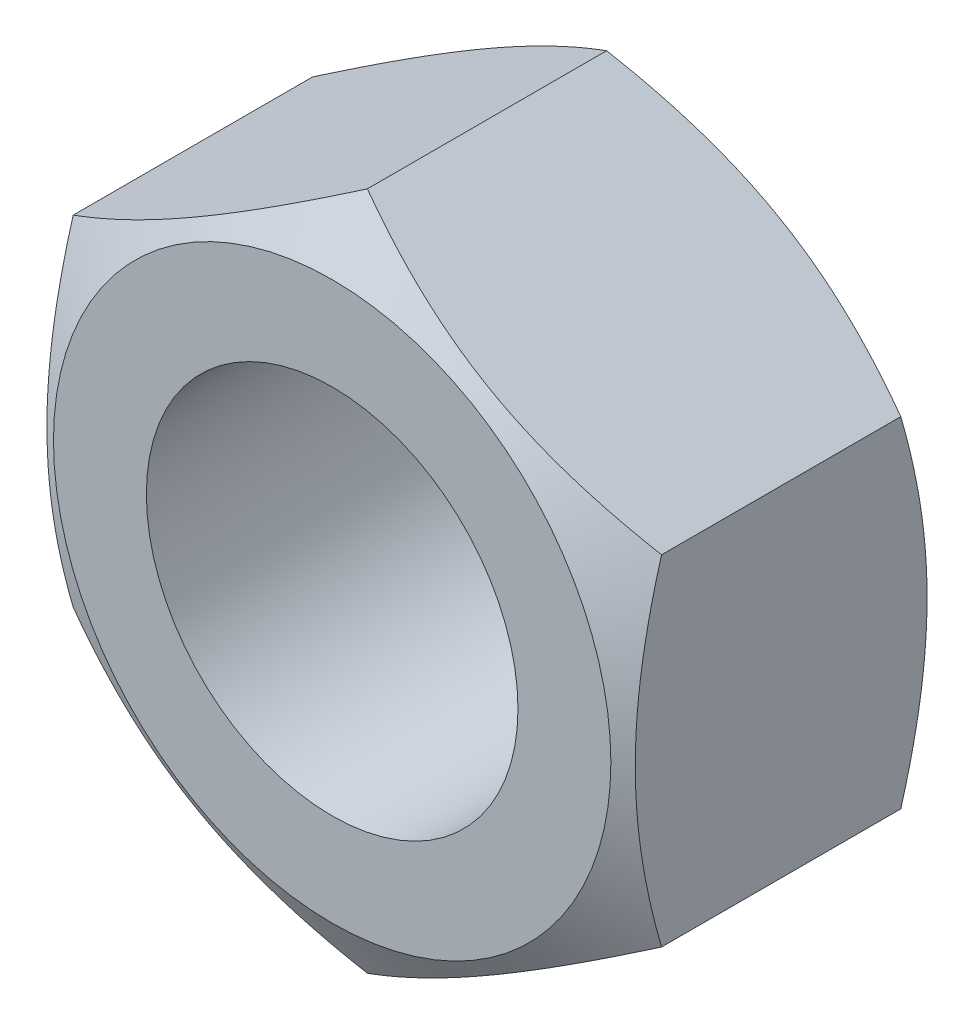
ISO-10303-21;
HEADER;
FILE_DESCRIPTION(('STEP AP214'),'2;1');
FILE_NAME('part.step','',(''),(''),'','','');
FILE_SCHEMA(('AUTOMOTIVE_DESIGN { 1 0 10303 214 1 1 1 1 }'));
ENDSEC;
DATA;
#1=APPLICATION_CONTEXT('core data for automotive mechanical design processes');
#2=APPLICATION_PROTOCOL_DEFINITION('international standard','automotive_design',2000,#1);
#3=PRODUCT_CONTEXT('',#1,'mechanical');
#4=PRODUCT('Part','Part','',(#3));
#5=PRODUCT_RELATED_PRODUCT_CATEGORY('part','',(#4));
#6=PRODUCT_DEFINITION_FORMATION('','',#4);
#7=PRODUCT_DEFINITION_CONTEXT('part definition',#1,'design');
#8=PRODUCT_DEFINITION('design','',#6,#7);
#9=PRODUCT_DEFINITION_SHAPE('','',#8);
#10=(LENGTH_UNIT() NAMED_UNIT(*) SI_UNIT(.MILLI.,.METRE.));
#11=(NAMED_UNIT(*) PLANE_ANGLE_UNIT() SI_UNIT($,.RADIAN.));
#12=(NAMED_UNIT(*) SI_UNIT($,.STERADIAN.) SOLID_ANGLE_UNIT());
#13=UNCERTAINTY_MEASURE_WITH_UNIT(LENGTH_MEASURE(1.E-05),#10,'distance_accuracy_value','');
#14=(GEOMETRIC_REPRESENTATION_CONTEXT(3) GLOBAL_UNCERTAINTY_ASSIGNED_CONTEXT((#13)) GLOBAL_UNIT_ASSIGNED_CONTEXT((#10,
#11,#12)) REPRESENTATION_CONTEXT('',''));
#15=CARTESIAN_POINT('',(0.,0.,0.));
#16=DIRECTION('',(0.,0.,1.));
#17=DIRECTION('',(1.,0.,0.));
#18=AXIS2_PLACEMENT_3D('',#15,#16,#17);
#19=CARTESIAN_POINT('',(-9.5,-5.48482755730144,10.));
#20=DIRECTION('',(-1.,0.,0.));
#21=DIRECTION('',(0.,0.,1.));
#22=AXIS2_PLACEMENT_3D('',#19,#20,#21);
#23=PLANE('',#22);
#24=DIRECTION('',(0.,0.,-1.));
#25=VECTOR('',#24,1.);
#26=CARTESIAN_POINT('',(-9.5,-5.48482755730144,10.));
#27=LINE('',#26,#25);
#28=CARTESIAN_POINT('',(-9.5,-5.48482755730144,8.86281908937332));
#29=VERTEX_POINT('',#28);
#30=CARTESIAN_POINT('',(-9.5,-5.48482755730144,1.13718091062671));
#31=VERTEX_POINT('',#30);
#32=EDGE_CURVE('E9',#29,#31,#27,.T.);
#33=ORIENTED_EDGE('',*,*,#32,.F.);
#34=CARTESIAN_POINT('',(-9.5,-14.6203705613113,5.12961982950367));
#35=CARTESIAN_POINT('',(-9.5,-14.4133760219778,5.22982896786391));
#36=CARTESIAN_POINT('',(-9.5,-14.2061355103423,5.32952978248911));
#37=CARTESIAN_POINT('',(-9.5,-13.7911111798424,5.52779940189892));
#38=CARTESIAN_POINT('',(-9.5,-13.5833273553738,5.62636819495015));
#39=CARTESIAN_POINT('',(-9.5,-12.959026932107,5.92023022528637));
#40=CARTESIAN_POINT('',(-9.5,-12.5416243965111,6.11364852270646));
#41=CARTESIAN_POINT('',(-9.5,-11.7016619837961,6.49535955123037));
#42=CARTESIAN_POINT('',(-9.5,-11.279086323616,6.68361763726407));
#43=CARTESIAN_POINT('',(-9.5,-10.4305349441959,7.05228047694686));
#44=CARTESIAN_POINT('',(-9.5,-10.004559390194,7.23268560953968));
#45=CARTESIAN_POINT('',(-9.5,-9.13523598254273,7.58900936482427));
#46=CARTESIAN_POINT('',(-9.5,-8.69175917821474,7.7646151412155));
#47=CARTESIAN_POINT('',(-9.5,-7.79957695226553,8.10226180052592));
#48=CARTESIAN_POINT('',(-9.5,-7.3508709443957,8.26430114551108));
#49=CARTESIAN_POINT('',(-9.5,-6.44838780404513,8.57047760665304));
#50=CARTESIAN_POINT('',(-9.5,-5.99462344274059,8.71465195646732));
#51=CARTESIAN_POINT('',(-9.5,-5.08060402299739,8.98040038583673));
#52=CARTESIAN_POINT('',(-9.5,-4.62035109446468,9.10198170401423));
#53=CARTESIAN_POINT('',(-9.5,-3.69554066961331,9.31598884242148));
#54=CARTESIAN_POINT('',(-9.5,-3.23101965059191,9.40856799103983));
#55=CARTESIAN_POINT('',(-9.5,-2.53009968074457,9.52161967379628));
#56=CARTESIAN_POINT('',(-9.5,-2.29575188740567,9.55500229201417));
#57=CARTESIAN_POINT('',(-9.5,-1.82593015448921,9.61250466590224));
#58=CARTESIAN_POINT('',(-9.5,-1.59045632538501,9.63662531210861));
#59=CARTESIAN_POINT('',(-9.5,-1.12172453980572,9.67482643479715));
#60=CARTESIAN_POINT('',(-9.5,-0.888476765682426,9.68903138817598));
#61=CARTESIAN_POINT('',(-9.5,-0.421589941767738,9.70757316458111));
#62=CARTESIAN_POINT('',(-9.5,-0.187950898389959,9.7119101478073));
#63=CARTESIAN_POINT('',(-9.5,0.279302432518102,9.710612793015));
#64=CARTESIAN_POINT('',(-9.5,0.512916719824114,9.70497837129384));
#65=CARTESIAN_POINT('',(-9.5,0.979703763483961,9.68387374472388));
#66=CARTESIAN_POINT('',(-9.5,1.21287649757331,9.66840305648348));
#67=CARTESIAN_POINT('',(-9.5,1.7767093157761,9.61942455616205));
#68=CARTESIAN_POINT('',(-9.5,2.10695454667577,9.58105864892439));
#69=CARTESIAN_POINT('',(-9.5,2.76492123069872,9.48671274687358));
#70=CARTESIAN_POINT('',(-9.5,3.09264232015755,9.43073026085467));
#71=CARTESIAN_POINT('',(-9.5,3.74527313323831,9.30314290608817));
#72=CARTESIAN_POINT('',(-9.5,4.07018038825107,9.23152552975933));
#73=CARTESIAN_POINT('',(-9.5,4.71670052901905,9.0748470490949));
#74=CARTESIAN_POINT('',(-9.5,5.03831347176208,8.98978617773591));
#75=CARTESIAN_POINT('',(-9.5,5.68526467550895,8.80628787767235));
#76=CARTESIAN_POINT('',(-9.5,6.01053116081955,8.70759912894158));
#77=CARTESIAN_POINT('',(-9.5,6.65785880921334,8.50026912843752));
#78=CARTESIAN_POINT('',(-9.5,6.97991995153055,8.39162781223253));
#79=CARTESIAN_POINT('',(-9.5,7.6210004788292,8.16609623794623));
#80=CARTESIAN_POINT('',(-9.5,7.94002088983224,8.04920888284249));
#81=CARTESIAN_POINT('',(-9.5,8.5754344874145,7.80853638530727));
#82=CARTESIAN_POINT('',(-9.5,8.89182770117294,7.68475131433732));
#83=CARTESIAN_POINT('',(-9.5,9.62350368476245,7.3907636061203));
#84=CARTESIAN_POINT('',(-9.5,10.0379237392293,7.21841738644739));
#85=CARTESIAN_POINT('',(-9.5,10.8633742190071,6.86576825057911));
#86=CARTESIAN_POINT('',(-9.5,11.2744044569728,6.68546489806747));
#87=CARTESIAN_POINT('',(-9.5,12.0936880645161,6.31845543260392));
#88=CARTESIAN_POINT('',(-9.5,12.5019408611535,6.13174804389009));
#89=CARTESIAN_POINT('',(-9.5,13.3160389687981,5.7531881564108));
#90=CARTESIAN_POINT('',(-9.5,13.7218843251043,5.56133575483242));
#91=CARTESIAN_POINT('',(-9.5,14.5319664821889,5.17323028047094));
#92=CARTESIAN_POINT('',(-9.5,14.9362012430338,4.9769729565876));
#93=CARTESIAN_POINT('',(-9.5,15.7429612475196,4.58097715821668));
#94=CARTESIAN_POINT('',(-9.5,16.145486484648,4.38123867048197));
#95=CARTESIAN_POINT('',(-9.5,17.3508043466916,3.77775226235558));
#96=CARTESIAN_POINT('',(-9.5,18.1514351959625,3.36968700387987));
#97=CARTESIAN_POINT('',(-9.5,19.6840581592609,2.5786437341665));
#98=CARTESIAN_POINT('',(-9.5,20.4163776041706,2.19629716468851));
#99=CARTESIAN_POINT('',(-9.5,21.8782922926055,1.42637873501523));
#100=CARTESIAN_POINT('',(-9.5,22.607887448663,1.03880670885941));
#101=CARTESIAN_POINT('',(-9.5,24.0632507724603,0.260571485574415));
#102=CARTESIAN_POINT('',(-9.5,24.7890238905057,-0.130082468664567));
#103=CARTESIAN_POINT('',(-9.5,26.2388196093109,-0.914537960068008));
#104=CARTESIAN_POINT('',(-9.5,26.9628422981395,-1.30833933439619));
#105=CARTESIAN_POINT('',(-9.5,27.686216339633,-1.70332069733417));
#106=B_SPLINE_CURVE_WITH_KNOTS('',3,(#34,#35,#36,#37,#38,#39,#40,#41,#42,#43,#44,#45,#46,#47,
#48,#49,#50,#51,#52,#53,#54,#55,#56,#57,#58,#59,#60,#61,#62,#63,#64,#65,#66,#67,#68,#69,#70,#71,
#72,#73,#74,#75,#76,#77,#78,#79,#80,#81,#82,#83,#84,#85,#86,#87,#88,#89,#90,#91,#92,#93,#94,#95,
#96,#97,#98,#99,#100,#101,#102,#103,#104,#105),.UNSPECIFIED.,.F.,.F.,(4,2,2,2,2,2,2,2,2,2,2,2,2,
2,2,2,2,2,2,2,2,2,2,2,2,2,2,2,2,2,2,2,2,2,2,4),(0.,0.689924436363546,1.37985601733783,
2.7599293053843,4.14770758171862,5.53541881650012,6.9661840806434,8.39711132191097,
9.82500423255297,11.2524388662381,12.6721943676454,13.38218061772,14.0920985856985,
14.7929360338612,15.4937621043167,16.1945940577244,16.8954604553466,17.8923053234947,
18.8892912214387,19.8870776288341,20.8848467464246,21.9043812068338,22.9239222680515,
23.9431061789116,24.9622795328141,26.3086543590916,27.6551031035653,29.0018216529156,
30.348514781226,31.6965687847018,33.0446279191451,35.7404261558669,38.2187752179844,
40.6972031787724,43.1698886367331,45.6424469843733),.UNSPECIFIED.);
#107=CARTESIAN_POINT('',(-9.5,5.48482755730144,8.86281908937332));
#108=VERTEX_POINT('',#107);
#109=EDGE_CURVE('E69',#29,#108,#106,.T.);
#110=ORIENTED_EDGE('',*,*,#109,.T.);
#111=DIRECTION('',(0.,0.,-1.));
#112=VECTOR('',#111,1.);
#113=CARTESIAN_POINT('',(-9.5,5.48482755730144,10.));
#114=LINE('',#113,#112);
#115=CARTESIAN_POINT('',(-9.5,5.48482755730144,1.1371809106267));
#116=VERTEX_POINT('',#115);
#117=EDGE_CURVE('E38',#108,#116,#114,.T.);
#118=ORIENTED_EDGE('',*,*,#117,.T.);
#119=CARTESIAN_POINT('',(-9.5,-14.6687006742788,4.8937894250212));
#120=CARTESIAN_POINT('',(-9.5,-14.4615084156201,4.79338645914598));
#121=CARTESIAN_POINT('',(-9.5,-14.2540712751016,4.69348906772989));
#122=CARTESIAN_POINT('',(-9.5,-13.8386561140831,4.4948200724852));
#123=CARTESIAN_POINT('',(-9.5,-13.63067808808,4.39604848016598));
#124=CARTESIAN_POINT('',(-9.5,-13.0057997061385,4.10156789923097));
#125=CARTESIAN_POINT('',(-9.5,-12.5880173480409,3.90772338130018));
#126=CARTESIAN_POINT('',(-9.5,-11.7473306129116,3.52513337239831));
#127=CARTESIAN_POINT('',(-9.5,-11.3244106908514,3.33642195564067));
#128=CARTESIAN_POINT('',(-9.5,-10.4751851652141,2.96680533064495));
#129=CARTESIAN_POINT('',(-9.5,-10.0488797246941,2.78589974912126));
#130=CARTESIAN_POINT('',(-9.5,-9.17870639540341,2.42841765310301));
#131=CARTESIAN_POINT('',(-9.5,-8.73470813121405,2.25215673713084));
#132=CARTESIAN_POINT('',(-9.5,-7.84149462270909,1.91313091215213));
#133=CARTESIAN_POINT('',(-9.5,-7.39227879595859,1.75036752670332));
#134=CARTESIAN_POINT('',(-9.5,-6.48877170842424,1.44265749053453));
#135=CARTESIAN_POINT('',(-9.5,-6.03449305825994,1.29767421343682));
#136=CARTESIAN_POINT('',(-9.5,-5.11943656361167,1.03021677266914));
#137=CARTESIAN_POINT('',(-9.5,-4.65866083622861,0.90773545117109));
#138=CARTESIAN_POINT('',(-9.5,-3.73280971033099,0.69185651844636));
#139=CARTESIAN_POINT('',(-9.5,-3.26777143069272,0.598304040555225));
#140=CARTESIAN_POINT('',(-9.5,-2.56603115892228,0.483755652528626));
#141=CARTESIAN_POINT('',(-9.5,-2.33140289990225,0.449868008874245));
#142=CARTESIAN_POINT('',(-9.5,-1.86100211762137,0.391352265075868));
#143=CARTESIAN_POINT('',(-9.5,-1.62522970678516,0.366723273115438));
#144=CARTESIAN_POINT('',(-9.5,-1.15590855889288,0.32752110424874));
#145=CARTESIAN_POINT('',(-9.5,-0.922370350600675,0.3128223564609));
#146=CARTESIAN_POINT('',(-9.5,-0.454881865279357,0.293309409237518));
#147=CARTESIAN_POINT('',(-9.5,-0.220931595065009,0.288495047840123));
#148=CARTESIAN_POINT('',(-9.5,0.24696380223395,0.288865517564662));
#149=CARTESIAN_POINT('',(-9.5,0.480908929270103,0.294050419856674));
#150=CARTESIAN_POINT('',(-9.5,0.948374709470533,0.314293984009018));
#151=CARTESIAN_POINT('',(-9.5,1.1818953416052,0.329353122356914));
#152=CARTESIAN_POINT('',(-9.5,1.74506682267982,0.377260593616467));
#153=CARTESIAN_POINT('',(-9.5,2.07431695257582,0.414902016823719));
#154=CARTESIAN_POINT('',(-9.5,2.73033314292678,0.507748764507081));
#155=CARTESIAN_POINT('',(-9.5,3.05709885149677,0.562956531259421));
#156=CARTESIAN_POINT('',(-9.5,3.70784821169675,0.688971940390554));
#157=CARTESIAN_POINT('',(-9.5,4.0318294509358,0.759791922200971));
#158=CARTESIAN_POINT('',(-9.5,4.6765223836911,0.914874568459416));
#159=CARTESIAN_POINT('',(-9.5,4.99723413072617,0.999137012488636));
#160=CARTESIAN_POINT('',(-9.5,5.64242354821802,1.18104499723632));
#161=CARTESIAN_POINT('',(-9.5,5.9668293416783,1.27894371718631));
#162=CARTESIAN_POINT('',(-9.5,6.61244437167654,1.48471494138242));
#163=CARTESIAN_POINT('',(-9.5,6.93365358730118,1.59258751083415));
#164=CARTESIAN_POINT('',(-9.5,7.57303689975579,1.81660597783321));
#165=CARTESIAN_POINT('',(-9.5,7.89121199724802,1.93274903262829));
#166=CARTESIAN_POINT('',(-9.5,8.52493489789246,2.17195591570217));
#167=CARTESIAN_POINT('',(-9.5,8.84048273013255,2.29501966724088));
#168=CARTESIAN_POINT('',(-9.5,9.57839301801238,2.59064158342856));
#169=CARTESIAN_POINT('',(-9.5,9.99981165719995,2.76555194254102));
#170=CARTESIAN_POINT('',(-9.5,10.8391313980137,3.12364137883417));
#171=CARTESIAN_POINT('',(-9.5,11.2570322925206,3.30682093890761));
#172=CARTESIAN_POINT('',(-9.5,12.0899638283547,3.67981000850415));
#173=CARTESIAN_POINT('',(-9.5,12.5049938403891,3.86962091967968));
#174=CARTESIAN_POINT('',(-9.5,13.3325690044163,4.25455026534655));
#175=CARTESIAN_POINT('',(-9.5,13.7451142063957,4.44966859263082));
#176=CARTESIAN_POINT('',(-9.5,14.5685623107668,4.84443708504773));
#177=CARTESIAN_POINT('',(-9.5,14.9794630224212,5.0440918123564));
#178=CARTESIAN_POINT('',(-9.5,15.7995097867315,5.44697126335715));
#179=CARTESIAN_POINT('',(-9.5,16.2086558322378,5.65019600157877));
#180=CARTESIAN_POINT('',(-9.5,17.4337773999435,6.26423545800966));
#181=CARTESIAN_POINT('',(-9.5,18.2475397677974,6.67946539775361));
#182=CARTESIAN_POINT('',(-9.5,19.8038422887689,7.48365456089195));
#183=CARTESIAN_POINT('',(-9.5,20.5467231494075,7.87195733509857));
#184=CARTESIAN_POINT('',(-9.5,22.0297276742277,8.65384922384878));
#185=CARTESIAN_POINT('',(-9.5,22.7698512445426,9.047438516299));
#186=CARTESIAN_POINT('',(-9.5,24.2461609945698,9.8376962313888));
#187=CARTESIAN_POINT('',(-9.5,24.9823523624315,10.2343549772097));
#188=CARTESIAN_POINT('',(-9.5,26.4529685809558,11.0308418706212));
#189=CARTESIAN_POINT('',(-9.5,27.187393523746,11.4306698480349));
#190=CARTESIAN_POINT('',(-9.5,27.9211664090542,11.8316829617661));
#191=B_SPLINE_CURVE_WITH_KNOTS('',3,(#119,#120,#121,#122,#123,#124,#125,#126,#127,#128,#129,
#130,#131,#132,#133,#134,#135,#136,#137,#138,#139,#140,#141,#142,#143,#144,#145,#146,#147,#148,
#149,#150,#151,#152,#153,#154,#155,#156,#157,#158,#159,#160,#161,#162,#163,#164,#165,#166,#167,
#168,#169,#170,#171,#172,#173,#174,#175,#176,#177,#178,#179,#180,#181,#182,#183,#184,#185,#186,
#187,#188,#189,#190),.UNSPECIFIED.,.F.,.F.,(4,2,2,2,2,2,2,2,2,2,2,2,2,2,2,2,2,2,2,2,2,2,2,2,2,2,
2,2,2,2,2,2,2,2,2,4),(0.,0.690711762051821,1.38143057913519,2.76307600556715,4.15235213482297,
5.54156175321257,6.97450756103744,8.40761489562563,9.83771864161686,11.2673666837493,
12.6892232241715,13.4002577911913,14.1112238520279,14.8130222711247,15.5148091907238,
16.2166011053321,16.9184268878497,17.9120601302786,18.9058315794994,19.9003913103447,
20.8949347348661,21.911310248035,22.9276924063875,23.9437268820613,24.9597500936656,
26.3284573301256,27.6972445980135,29.0663229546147,30.4353736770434,31.8058681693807,
33.1763682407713,35.9170238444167,38.4317295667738,40.9465201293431,43.455265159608,
45.9638763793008),.UNSPECIFIED.);
#192=EDGE_CURVE('E89',#31,#116,#191,.T.);
#193=ORIENTED_EDGE('',*,*,#192,.F.);
#194=EDGE_LOOP('',(#33,#110,#118,#193));
#195=FACE_BOUND('',#194,.T.);
#196=ADVANCED_FACE('F14',(#195),#23,.T.);
#197=CARTESIAN_POINT('',(-9.5,-5.48482755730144,10.));
#198=DIRECTION('',(0.5,0.86602540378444,0.));
#199=DIRECTION('',(-0.86602540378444,0.5,0.));
#200=AXIS2_PLACEMENT_3D('',#197,#198,#199);
#201=PLANE('',#200);
#202=CARTESIAN_POINT('',(-9.5002,-5.4847120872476,8.86275242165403));
#203=CARTESIAN_POINT('',(-9.2913692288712,-5.60528058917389,8.93235142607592));
#204=CARTESIAN_POINT('',(-9.08175982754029,-5.72629863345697,8.99879155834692));
#205=CARTESIAN_POINT('',(-8.66086011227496,-5.96930519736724,9.1244775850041));
#206=CARTESIAN_POINT('',(-8.44956926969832,-6.09129402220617,9.18372111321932));
#207=CARTESIAN_POINT('',(-7.81229220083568,-6.45922610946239,9.34951029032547));
#208=CARTESIAN_POINT('',(-7.38379023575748,-6.70662183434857,9.4438104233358));
#209=CARTESIAN_POINT('',(-6.74255666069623,-7.07683821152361,9.55438616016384));
#210=CARTESIAN_POINT('',(-6.53174078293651,-7.19855281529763,9.58588503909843));
#211=CARTESIAN_POINT('',(-6.10913296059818,-7.4425455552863,9.63870666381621));
#212=CARTESIAN_POINT('',(-5.89734099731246,-7.56482370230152,9.66002921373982));
#213=CARTESIAN_POINT('',(-5.47340378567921,-7.80958396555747,9.69195184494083));
#214=CARTESIAN_POINT('',(-5.26125925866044,-7.93206566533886,9.70256466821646));
#215=CARTESIAN_POINT('',(-4.83677424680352,-8.17714220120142,9.71284233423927));
#216=CARTESIAN_POINT('',(-4.62443376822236,-8.2997370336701,9.71250751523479));
#217=CARTESIAN_POINT('',(-4.22745800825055,-8.52893109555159,9.70165149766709));
#218=CARTESIAN_POINT('',(-4.04279470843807,-8.63554650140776,9.69245459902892));
#219=CARTESIAN_POINT('',(-3.67389999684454,-8.84852796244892,9.66595946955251));
#220=CARTESIAN_POINT('',(-3.48966861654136,-8.95489399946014,9.64866066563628));
#221=CARTESIAN_POINT('',(-2.937688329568,-9.27357996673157,9.58502038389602));
#222=CARTESIAN_POINT('',(-2.57091646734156,-9.48533580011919,9.52694296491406));
#223=CARTESIAN_POINT('',(-1.83348217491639,-9.91109368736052,9.38174885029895));
#224=CARTESIAN_POINT('',(-1.46291385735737,-10.1250414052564,9.29401669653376));
#225=CARTESIAN_POINT('',(-0.727303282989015,-10.5497463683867,9.09490112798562));
#226=CARTESIAN_POINT('',(-0.36225160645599,-10.7605090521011,8.98356447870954));
#227=CARTESIAN_POINT('',(0.000200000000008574,-10.9697705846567,8.86275242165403));
#228=B_SPLINE_CURVE_WITH_KNOTS('',3,(#202,#203,#204,#205,#206,#207,#208,#209,#210,#211,#212,
#213,#214,#215,#216,#217,#218,#219,#220,#221,#222,#223,#224,#225,#226,#227),.UNSPECIFIED.,.F.,
.F.,(4,2,2,2,2,2,2,2,2,2,2,2,4),(0.,0.752880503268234,1.50600787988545,3.0154687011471,
3.75167336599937,4.48789219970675,5.22323407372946,5.95855322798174,6.5986808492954,
7.23885375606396,8.52010929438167,9.82978009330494,11.1368800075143),.UNSPECIFIED.);
#229=CARTESIAN_POINT('',(0.,-10.9696551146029,8.86281908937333));
#230=VERTEX_POINT('',#229);
#231=EDGE_CURVE('E77',#29,#230,#228,.T.);
#232=ORIENTED_EDGE('',*,*,#231,.F.);
#233=ORIENTED_EDGE('',*,*,#32,.T.);
#234=CARTESIAN_POINT('',(-9.5002,-5.4847120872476,1.13724757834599));
#235=CARTESIAN_POINT('',(-9.2913692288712,-5.60528058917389,1.06764857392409));
#236=CARTESIAN_POINT('',(-9.08175982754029,-5.72629863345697,1.00120844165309));
#237=CARTESIAN_POINT('',(-8.66086011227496,-5.96930519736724,0.875522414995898));
#238=CARTESIAN_POINT('',(-8.44956926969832,-6.09129402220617,0.816278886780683));
#239=CARTESIAN_POINT('',(-7.81229220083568,-6.45922610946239,0.650489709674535));
#240=CARTESIAN_POINT('',(-7.38379023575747,-6.70662183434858,0.556189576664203));
#241=CARTESIAN_POINT('',(-6.74255666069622,-7.07683821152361,0.44561383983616));
#242=CARTESIAN_POINT('',(-6.53174078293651,-7.19855281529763,0.414114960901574));
#243=CARTESIAN_POINT('',(-6.10913296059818,-7.44254555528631,0.361293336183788));
#244=CARTESIAN_POINT('',(-5.89734099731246,-7.56482370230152,0.33997078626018));
#245=CARTESIAN_POINT('',(-5.4734037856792,-7.80958396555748,0.308048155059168));
#246=CARTESIAN_POINT('',(-5.26125925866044,-7.93206566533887,0.297435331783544));
#247=CARTESIAN_POINT('',(-4.83677424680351,-8.17714220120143,0.287157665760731));
#248=CARTESIAN_POINT('',(-4.62443376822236,-8.29973703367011,0.287492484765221));
#249=CARTESIAN_POINT('',(-4.22745800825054,-8.5289310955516,0.298348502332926));
#250=CARTESIAN_POINT('',(-4.04279470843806,-8.63554650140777,0.30754540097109));
#251=CARTESIAN_POINT('',(-3.67389999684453,-8.84852796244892,0.334040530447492));
#252=CARTESIAN_POINT('',(-3.48966861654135,-8.95489399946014,0.35133933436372));
#253=CARTESIAN_POINT('',(-2.93768832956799,-9.27357996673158,0.414979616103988));
#254=CARTESIAN_POINT('',(-2.57091646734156,-9.48533580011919,0.473057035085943));
#255=CARTESIAN_POINT('',(-1.83348217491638,-9.91109368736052,0.618251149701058));
#256=CARTESIAN_POINT('',(-1.46291385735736,-10.1250414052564,0.705983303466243));
#257=CARTESIAN_POINT('',(-0.727303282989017,-10.5497463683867,0.905098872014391));
#258=CARTESIAN_POINT('',(-0.362251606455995,-10.7605090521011,1.01643552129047));
#259=CARTESIAN_POINT('',(0.00020000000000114,-10.9697705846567,1.13724757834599));
#260=B_SPLINE_CURVE_WITH_KNOTS('',3,(#234,#235,#236,#237,#238,#239,#240,#241,#242,#243,#244,
#245,#246,#247,#248,#249,#250,#251,#252,#253,#254,#255,#256,#257,#258,#259),.UNSPECIFIED.,.F.,
.F.,(4,2,2,2,2,2,2,2,2,2,2,2,4),(0.,0.752880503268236,1.50600787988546,3.01546870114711,
3.75167336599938,4.48789219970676,5.22323407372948,5.95855322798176,6.59868084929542,
7.23885375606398,8.52010929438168,9.82978009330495,11.1368800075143),.UNSPECIFIED.);
#261=CARTESIAN_POINT('',(0.,-10.9696551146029,1.1371809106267));
#262=VERTEX_POINT('',#261);
#263=EDGE_CURVE('E111',#31,#262,#260,.T.);
#264=ORIENTED_EDGE('',*,*,#263,.T.);
#265=DIRECTION('',(0.,0.,-1.));
#266=VECTOR('',#265,1.);
#267=CARTESIAN_POINT('',(0.,-10.9696551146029,10.));
#268=LINE('',#267,#266);
#269=EDGE_CURVE('E23',#230,#262,#268,.T.);
#270=ORIENTED_EDGE('',*,*,#269,.F.);
#271=EDGE_LOOP('',(#232,#233,#264,#270));
#272=FACE_BOUND('',#271,.T.);
#273=ADVANCED_FACE('F16',(#272),#201,.F.);
#274=CARTESIAN_POINT('',(9.5,-5.48482755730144,10.));
#275=DIRECTION('',(0.5,-0.86602540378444,0.));
#276=DIRECTION('',(0.86602540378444,0.5,0.));
#277=AXIS2_PLACEMENT_3D('',#274,#275,#276);
#278=PLANE('',#277);
#279=DIRECTION('',(0.,0.,-1.));
#280=VECTOR('',#279,1.);
#281=CARTESIAN_POINT('',(9.5,-5.48482755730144,10.));
#282=LINE('',#281,#280);
#283=CARTESIAN_POINT('',(9.5,-5.48482755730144,8.86281908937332));
#284=VERTEX_POINT('',#283);
#285=CARTESIAN_POINT('',(9.5,-5.48482755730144,1.13718091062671));
#286=VERTEX_POINT('',#285);
#287=EDGE_CURVE('E94',#284,#286,#282,.T.);
#288=ORIENTED_EDGE('',*,*,#287,.F.);
#289=CARTESIAN_POINT('',(9.5002,-5.4847120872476,8.86275242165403));
#290=CARTESIAN_POINT('',(9.2913692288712,-5.60528058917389,8.93235142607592));
#291=CARTESIAN_POINT('',(9.08175982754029,-5.72629863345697,8.99879155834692));
#292=CARTESIAN_POINT('',(8.66086011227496,-5.96930519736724,9.1244775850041));
#293=CARTESIAN_POINT('',(8.44956926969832,-6.09129402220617,9.18372111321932));
#294=CARTESIAN_POINT('',(7.81229220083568,-6.45922610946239,9.34951029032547));
#295=CARTESIAN_POINT('',(7.38379023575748,-6.70662183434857,9.4438104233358));
#296=CARTESIAN_POINT('',(6.74255666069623,-7.07683821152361,9.55438616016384));
#297=CARTESIAN_POINT('',(6.53174078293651,-7.19855281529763,9.58588503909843));
#298=CARTESIAN_POINT('',(6.10913296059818,-7.4425455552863,9.63870666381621));
#299=CARTESIAN_POINT('',(5.89734099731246,-7.56482370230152,9.66002921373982));
#300=CARTESIAN_POINT('',(5.47340378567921,-7.80958396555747,9.69195184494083));
#301=CARTESIAN_POINT('',(5.26125925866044,-7.93206566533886,9.70256466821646));
#302=CARTESIAN_POINT('',(4.83677424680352,-8.17714220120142,9.71284233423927));
#303=CARTESIAN_POINT('',(4.62443376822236,-8.2997370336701,9.71250751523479));
#304=CARTESIAN_POINT('',(4.22745800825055,-8.52893109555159,9.70165149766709));
#305=CARTESIAN_POINT('',(4.04279470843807,-8.63554650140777,9.69245459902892));
#306=CARTESIAN_POINT('',(3.67389999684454,-8.84852796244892,9.66595946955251));
#307=CARTESIAN_POINT('',(3.48966861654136,-8.95489399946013,9.64866066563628));
#308=CARTESIAN_POINT('',(2.937688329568,-9.27357996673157,9.58502038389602));
#309=CARTESIAN_POINT('',(2.57091646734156,-9.48533580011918,9.52694296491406));
#310=CARTESIAN_POINT('',(1.83348217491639,-9.91109368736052,9.38174885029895));
#311=CARTESIAN_POINT('',(1.46291385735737,-10.1250414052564,9.29401669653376));
#312=CARTESIAN_POINT('',(0.727303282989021,-10.5497463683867,9.09490112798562));
#313=CARTESIAN_POINT('',(0.362251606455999,-10.7605090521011,8.98356447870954));
#314=CARTESIAN_POINT('',(-0.000200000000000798,-10.9697705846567,8.86275242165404));
#315=B_SPLINE_CURVE_WITH_KNOTS('',3,(#289,#290,#291,#292,#293,#294,#295,#296,#297,#298,#299,
#300,#301,#302,#303,#304,#305,#306,#307,#308,#309,#310,#311,#312,#313,#314),.UNSPECIFIED.,.F.,
.F.,(4,2,2,2,2,2,2,2,2,2,2,2,4),(0.,0.752880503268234,1.50600787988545,3.0154687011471,
3.75167336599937,4.48789219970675,5.22323407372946,5.95855322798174,6.5986808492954,
7.23885375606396,8.52010929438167,9.82978009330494,11.1368800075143),.UNSPECIFIED.);
#316=EDGE_CURVE('E103',#284,#230,#315,.T.);
#317=ORIENTED_EDGE('',*,*,#316,.T.);
#318=ORIENTED_EDGE('',*,*,#269,.T.);
#319=CARTESIAN_POINT('',(9.5002,-5.4847120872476,1.13724757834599));
#320=CARTESIAN_POINT('',(9.2913692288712,-5.60528058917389,1.06764857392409));
#321=CARTESIAN_POINT('',(9.08175982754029,-5.72629863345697,1.00120844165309));
#322=CARTESIAN_POINT('',(8.66086011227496,-5.96930519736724,0.875522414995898));
#323=CARTESIAN_POINT('',(8.44956926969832,-6.09129402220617,0.816278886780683));
#324=CARTESIAN_POINT('',(7.81229220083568,-6.45922610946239,0.650489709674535));
#325=CARTESIAN_POINT('',(7.38379023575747,-6.70662183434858,0.556189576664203));
#326=CARTESIAN_POINT('',(6.74255666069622,-7.07683821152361,0.44561383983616));
#327=CARTESIAN_POINT('',(6.53174078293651,-7.19855281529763,0.414114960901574));
#328=CARTESIAN_POINT('',(6.10913296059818,-7.44254555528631,0.361293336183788));
#329=CARTESIAN_POINT('',(5.89734099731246,-7.56482370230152,0.33997078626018));
#330=CARTESIAN_POINT('',(5.4734037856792,-7.80958396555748,0.308048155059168));
#331=CARTESIAN_POINT('',(5.26125925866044,-7.93206566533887,0.297435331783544));
#332=CARTESIAN_POINT('',(4.83677424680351,-8.17714220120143,0.287157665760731));
#333=CARTESIAN_POINT('',(4.62443376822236,-8.29973703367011,0.287492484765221));
#334=CARTESIAN_POINT('',(4.22745800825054,-8.5289310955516,0.298348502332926));
#335=CARTESIAN_POINT('',(4.04279470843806,-8.63554650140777,0.30754540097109));
#336=CARTESIAN_POINT('',(3.67389999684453,-8.84852796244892,0.334040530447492));
#337=CARTESIAN_POINT('',(3.48966861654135,-8.95489399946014,0.35133933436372));
#338=CARTESIAN_POINT('',(2.93768832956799,-9.27357996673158,0.414979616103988));
#339=CARTESIAN_POINT('',(2.57091646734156,-9.48533580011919,0.473057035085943));
#340=CARTESIAN_POINT('',(1.83348217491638,-9.91109368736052,0.618251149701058));
#341=CARTESIAN_POINT('',(1.46291385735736,-10.1250414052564,0.705983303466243));
#342=CARTESIAN_POINT('',(0.727303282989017,-10.5497463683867,0.905098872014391));
#343=CARTESIAN_POINT('',(0.362251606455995,-10.7605090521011,1.01643552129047));
#344=CARTESIAN_POINT('',(-0.00020000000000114,-10.9697705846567,1.13724757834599));
#345=B_SPLINE_CURVE_WITH_KNOTS('',3,(#319,#320,#321,#322,#323,#324,#325,#326,#327,#328,#329,
#330,#331,#332,#333,#334,#335,#336,#337,#338,#339,#340,#341,#342,#343,#344),.UNSPECIFIED.,.F.,
.F.,(4,2,2,2,2,2,2,2,2,2,2,2,4),(0.,0.752880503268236,1.50600787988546,3.01546870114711,
3.75167336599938,4.48789219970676,5.22323407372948,5.95855322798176,6.59868084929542,
7.23885375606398,8.52010929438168,9.82978009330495,11.1368800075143),.UNSPECIFIED.);
#346=EDGE_CURVE('E102',#286,#262,#345,.T.);
#347=ORIENTED_EDGE('',*,*,#346,.F.);
#348=EDGE_LOOP('',(#288,#317,#318,#347));
#349=FACE_BOUND('',#348,.T.);
#350=ADVANCED_FACE('F101',(#349),#278,.T.);
#351=CARTESIAN_POINT('',(9.5,-5.48482755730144,10.));
#352=DIRECTION('',(-1.,0.,0.));
#353=DIRECTION('',(0.,0.,1.));
#354=AXIS2_PLACEMENT_3D('',#351,#352,#353);
#355=PLANE('',#354);
#356=CARTESIAN_POINT('',(9.5,-14.6203705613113,5.12961982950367));
#357=CARTESIAN_POINT('',(9.5,-14.4133760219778,5.22982896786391));
#358=CARTESIAN_POINT('',(9.5,-14.2061355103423,5.32952978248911));
#359=CARTESIAN_POINT('',(9.5,-13.7911111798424,5.52779940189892));
#360=CARTESIAN_POINT('',(9.5,-13.5833273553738,5.62636819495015));
#361=CARTESIAN_POINT('',(9.5,-12.959026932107,5.92023022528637));
#362=CARTESIAN_POINT('',(9.5,-12.5416243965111,6.11364852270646));
#363=CARTESIAN_POINT('',(9.5,-11.7016619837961,6.49535955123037));
#364=CARTESIAN_POINT('',(9.5,-11.279086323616,6.68361763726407));
#365=CARTESIAN_POINT('',(9.5,-10.4305349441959,7.05228047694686));
#366=CARTESIAN_POINT('',(9.5,-10.004559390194,7.23268560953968));
#367=CARTESIAN_POINT('',(9.5,-9.13523598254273,7.58900936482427));
#368=CARTESIAN_POINT('',(9.5,-8.69175917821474,7.7646151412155));
#369=CARTESIAN_POINT('',(9.5,-7.79957695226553,8.10226180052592));
#370=CARTESIAN_POINT('',(9.5,-7.3508709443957,8.26430114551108));
#371=CARTESIAN_POINT('',(9.5,-6.44838780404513,8.57047760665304));
#372=CARTESIAN_POINT('',(9.5,-5.99462344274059,8.71465195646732));
#373=CARTESIAN_POINT('',(9.5,-5.08060402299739,8.98040038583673));
#374=CARTESIAN_POINT('',(9.5,-4.62035109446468,9.10198170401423));
#375=CARTESIAN_POINT('',(9.5,-3.69554066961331,9.31598884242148));
#376=CARTESIAN_POINT('',(9.5,-3.23101965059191,9.40856799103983));
#377=CARTESIAN_POINT('',(9.5,-2.53009968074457,9.52161967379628));
#378=CARTESIAN_POINT('',(9.5,-2.29575188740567,9.55500229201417));
#379=CARTESIAN_POINT('',(9.5,-1.82593015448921,9.61250466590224));
#380=CARTESIAN_POINT('',(9.5,-1.59045632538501,9.63662531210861));
#381=CARTESIAN_POINT('',(9.5,-1.12172453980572,9.67482643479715));
#382=CARTESIAN_POINT('',(9.5,-0.888476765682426,9.68903138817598));
#383=CARTESIAN_POINT('',(9.5,-0.421589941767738,9.70757316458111));
#384=CARTESIAN_POINT('',(9.5,-0.187950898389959,9.7119101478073));
#385=CARTESIAN_POINT('',(9.5,0.279302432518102,9.710612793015));
#386=CARTESIAN_POINT('',(9.5,0.512916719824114,9.70497837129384));
#387=CARTESIAN_POINT('',(9.5,0.979703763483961,9.68387374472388));
#388=CARTESIAN_POINT('',(9.5,1.21287649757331,9.66840305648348));
#389=CARTESIAN_POINT('',(9.5,1.7767093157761,9.61942455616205));
#390=CARTESIAN_POINT('',(9.5,2.10695454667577,9.58105864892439));
#391=CARTESIAN_POINT('',(9.5,2.76492123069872,9.48671274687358));
#392=CARTESIAN_POINT('',(9.5,3.09264232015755,9.43073026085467));
#393=CARTESIAN_POINT('',(9.5,3.74527313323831,9.30314290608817));
#394=CARTESIAN_POINT('',(9.5,4.07018038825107,9.23152552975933));
#395=CARTESIAN_POINT('',(9.5,4.71670052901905,9.0748470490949));
#396=CARTESIAN_POINT('',(9.5,5.03831347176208,8.98978617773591));
#397=CARTESIAN_POINT('',(9.5,5.68526467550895,8.80628787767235));
#398=CARTESIAN_POINT('',(9.5,6.01053116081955,8.70759912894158));
#399=CARTESIAN_POINT('',(9.5,6.65785880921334,8.50026912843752));
#400=CARTESIAN_POINT('',(9.5,6.97991995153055,8.39162781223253));
#401=CARTESIAN_POINT('',(9.5,7.6210004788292,8.16609623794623));
#402=CARTESIAN_POINT('',(9.5,7.94002088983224,8.04920888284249));
#403=CARTESIAN_POINT('',(9.5,8.5754344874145,7.80853638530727));
#404=CARTESIAN_POINT('',(9.5,8.89182770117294,7.68475131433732));
#405=CARTESIAN_POINT('',(9.5,9.62350368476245,7.3907636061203));
#406=CARTESIAN_POINT('',(9.5,10.0379237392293,7.21841738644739));
#407=CARTESIAN_POINT('',(9.5,10.8633742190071,6.86576825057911));
#408=CARTESIAN_POINT('',(9.5,11.2744044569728,6.68546489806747));
#409=CARTESIAN_POINT('',(9.5,12.0936880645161,6.31845543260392));
#410=CARTESIAN_POINT('',(9.5,12.5019408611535,6.13174804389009));
#411=CARTESIAN_POINT('',(9.5,13.3160389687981,5.7531881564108));
#412=CARTESIAN_POINT('',(9.5,13.7218843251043,5.56133575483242));
#413=CARTESIAN_POINT('',(9.5,14.5319664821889,5.17323028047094));
#414=CARTESIAN_POINT('',(9.5,14.9362012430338,4.9769729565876));
#415=CARTESIAN_POINT('',(9.5,15.7429612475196,4.58097715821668));
#416=CARTESIAN_POINT('',(9.5,16.145486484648,4.38123867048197));
#417=CARTESIAN_POINT('',(9.5,17.3508043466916,3.77775226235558));
#418=CARTESIAN_POINT('',(9.5,18.1514351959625,3.36968700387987));
#419=CARTESIAN_POINT('',(9.5,19.6840581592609,2.5786437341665));
#420=CARTESIAN_POINT('',(9.5,20.4163776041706,2.19629716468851));
#421=CARTESIAN_POINT('',(9.5,21.8782922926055,1.42637873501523));
#422=CARTESIAN_POINT('',(9.5,22.607887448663,1.03880670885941));
#423=CARTESIAN_POINT('',(9.5,24.0632507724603,0.260571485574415));
#424=CARTESIAN_POINT('',(9.5,24.7890238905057,-0.130082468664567));
#425=CARTESIAN_POINT('',(9.5,26.2388196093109,-0.914537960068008));
#426=CARTESIAN_POINT('',(9.5,26.9628422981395,-1.30833933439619));
#427=CARTESIAN_POINT('',(9.5,27.686216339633,-1.70332069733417));
#428=B_SPLINE_CURVE_WITH_KNOTS('',3,(#356,#357,#358,#359,#360,#361,#362,#363,#364,#365,#366,
#367,#368,#369,#370,#371,#372,#373,#374,#375,#376,#377,#378,#379,#380,#381,#382,#383,#384,#385,
#386,#387,#388,#389,#390,#391,#392,#393,#394,#395,#396,#397,#398,#399,#400,#401,#402,#403,#404,
#405,#406,#407,#408,#409,#410,#411,#412,#413,#414,#415,#416,#417,#418,#419,#420,#421,#422,#423,
#424,#425,#426,#427),.UNSPECIFIED.,.F.,.F.,(4,2,2,2,2,2,2,2,2,2,2,2,2,2,2,2,2,2,2,2,2,2,2,2,2,2,
2,2,2,2,2,2,2,2,2,4),(0.,0.689924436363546,1.37985601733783,2.7599293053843,4.14770758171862,
5.53541881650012,6.9661840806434,8.39711132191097,9.82500423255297,11.2524388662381,
12.6721943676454,13.38218061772,14.0920985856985,14.7929360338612,15.4937621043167,
16.1945940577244,16.8954604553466,17.8923053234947,18.8892912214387,19.8870776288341,
20.8848467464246,21.9043812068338,22.9239222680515,23.9431061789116,24.9622795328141,
26.3086543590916,27.6551031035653,29.0018216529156,30.348514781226,31.6965687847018,
33.0446279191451,35.7404261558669,38.2187752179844,40.6972031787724,43.1698886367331,
45.6424469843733),.UNSPECIFIED.);
#429=CARTESIAN_POINT('',(9.5,5.48482755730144,8.86281908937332));
#430=VERTEX_POINT('',#429);
#431=EDGE_CURVE('E173',#284,#430,#428,.T.);
#432=ORIENTED_EDGE('',*,*,#431,.F.);
#433=ORIENTED_EDGE('',*,*,#287,.T.);
#434=CARTESIAN_POINT('',(9.5,-14.6687006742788,4.8937894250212));
#435=CARTESIAN_POINT('',(9.5,-14.4615084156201,4.79338645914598));
#436=CARTESIAN_POINT('',(9.5,-14.2540712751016,4.69348906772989));
#437=CARTESIAN_POINT('',(9.5,-13.8386561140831,4.4948200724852));
#438=CARTESIAN_POINT('',(9.5,-13.63067808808,4.39604848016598));
#439=CARTESIAN_POINT('',(9.5,-13.0057997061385,4.10156789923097));
#440=CARTESIAN_POINT('',(9.5,-12.5880173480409,3.90772338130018));
#441=CARTESIAN_POINT('',(9.5,-11.7473306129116,3.52513337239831));
#442=CARTESIAN_POINT('',(9.5,-11.3244106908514,3.33642195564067));
#443=CARTESIAN_POINT('',(9.5,-10.4751851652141,2.96680533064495));
#444=CARTESIAN_POINT('',(9.5,-10.0488797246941,2.78589974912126));
#445=CARTESIAN_POINT('',(9.5,-9.17870639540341,2.42841765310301));
#446=CARTESIAN_POINT('',(9.5,-8.73470813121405,2.25215673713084));
#447=CARTESIAN_POINT('',(9.5,-7.84149462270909,1.91313091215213));
#448=CARTESIAN_POINT('',(9.5,-7.39227879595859,1.75036752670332));
#449=CARTESIAN_POINT('',(9.5,-6.48877170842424,1.44265749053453));
#450=CARTESIAN_POINT('',(9.5,-6.03449305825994,1.29767421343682));
#451=CARTESIAN_POINT('',(9.5,-5.11943656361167,1.03021677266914));
#452=CARTESIAN_POINT('',(9.5,-4.65866083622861,0.90773545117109));
#453=CARTESIAN_POINT('',(9.5,-3.73280971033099,0.69185651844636));
#454=CARTESIAN_POINT('',(9.5,-3.26777143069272,0.598304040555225));
#455=CARTESIAN_POINT('',(9.5,-2.56603115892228,0.483755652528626));
#456=CARTESIAN_POINT('',(9.5,-2.33140289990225,0.449868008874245));
#457=CARTESIAN_POINT('',(9.5,-1.86100211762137,0.391352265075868));
#458=CARTESIAN_POINT('',(9.5,-1.62522970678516,0.366723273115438));
#459=CARTESIAN_POINT('',(9.5,-1.15590855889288,0.32752110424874));
#460=CARTESIAN_POINT('',(9.5,-0.922370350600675,0.3128223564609));
#461=CARTESIAN_POINT('',(9.5,-0.454881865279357,0.293309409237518));
#462=CARTESIAN_POINT('',(9.5,-0.220931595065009,0.288495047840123));
#463=CARTESIAN_POINT('',(9.5,0.24696380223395,0.288865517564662));
#464=CARTESIAN_POINT('',(9.5,0.480908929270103,0.294050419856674));
#465=CARTESIAN_POINT('',(9.5,0.948374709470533,0.314293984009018));
#466=CARTESIAN_POINT('',(9.5,1.1818953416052,0.329353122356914));
#467=CARTESIAN_POINT('',(9.5,1.74506682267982,0.377260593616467));
#468=CARTESIAN_POINT('',(9.5,2.07431695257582,0.414902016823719));
#469=CARTESIAN_POINT('',(9.5,2.73033314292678,0.507748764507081));
#470=CARTESIAN_POINT('',(9.5,3.05709885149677,0.562956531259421));
#471=CARTESIAN_POINT('',(9.5,3.70784821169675,0.688971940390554));
#472=CARTESIAN_POINT('',(9.5,4.0318294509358,0.759791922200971));
#473=CARTESIAN_POINT('',(9.5,4.6765223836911,0.914874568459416));
#474=CARTESIAN_POINT('',(9.5,4.99723413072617,0.999137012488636));
#475=CARTESIAN_POINT('',(9.5,5.64242354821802,1.18104499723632));
#476=CARTESIAN_POINT('',(9.5,5.9668293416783,1.27894371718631));
#477=CARTESIAN_POINT('',(9.5,6.61244437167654,1.48471494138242));
#478=CARTESIAN_POINT('',(9.5,6.93365358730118,1.59258751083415));
#479=CARTESIAN_POINT('',(9.5,7.57303689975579,1.81660597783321));
#480=CARTESIAN_POINT('',(9.5,7.89121199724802,1.93274903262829));
#481=CARTESIAN_POINT('',(9.5,8.52493489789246,2.17195591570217));
#482=CARTESIAN_POINT('',(9.5,8.84048273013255,2.29501966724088));
#483=CARTESIAN_POINT('',(9.5,9.57839301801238,2.59064158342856));
#484=CARTESIAN_POINT('',(9.5,9.99981165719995,2.76555194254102));
#485=CARTESIAN_POINT('',(9.5,10.8391313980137,3.12364137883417));
#486=CARTESIAN_POINT('',(9.5,11.2570322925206,3.30682093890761));
#487=CARTESIAN_POINT('',(9.5,12.0899638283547,3.67981000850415));
#488=CARTESIAN_POINT('',(9.5,12.5049938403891,3.86962091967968));
#489=CARTESIAN_POINT('',(9.5,13.3325690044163,4.25455026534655));
#490=CARTESIAN_POINT('',(9.5,13.7451142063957,4.44966859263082));
#491=CARTESIAN_POINT('',(9.5,14.5685623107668,4.84443708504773));
#492=CARTESIAN_POINT('',(9.5,14.9794630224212,5.0440918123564));
#493=CARTESIAN_POINT('',(9.5,15.7995097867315,5.44697126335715));
#494=CARTESIAN_POINT('',(9.5,16.2086558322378,5.65019600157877));
#495=CARTESIAN_POINT('',(9.5,17.4337773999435,6.26423545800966));
#496=CARTESIAN_POINT('',(9.5,18.2475397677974,6.67946539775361));
#497=CARTESIAN_POINT('',(9.5,19.8038422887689,7.48365456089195));
#498=CARTESIAN_POINT('',(9.5,20.5467231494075,7.87195733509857));
#499=CARTESIAN_POINT('',(9.5,22.0297276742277,8.65384922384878));
#500=CARTESIAN_POINT('',(9.5,22.7698512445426,9.047438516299));
#501=CARTESIAN_POINT('',(9.5,24.2461609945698,9.8376962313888));
#502=CARTESIAN_POINT('',(9.5,24.9823523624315,10.2343549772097));
#503=CARTESIAN_POINT('',(9.5,26.4529685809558,11.0308418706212));
#504=CARTESIAN_POINT('',(9.5,27.187393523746,11.4306698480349));
#505=CARTESIAN_POINT('',(9.5,27.9211664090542,11.8316829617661));
#506=B_SPLINE_CURVE_WITH_KNOTS('',3,(#434,#435,#436,#437,#438,#439,#440,#441,#442,#443,#444,
#445,#446,#447,#448,#449,#450,#451,#452,#453,#454,#455,#456,#457,#458,#459,#460,#461,#462,#463,
#464,#465,#466,#467,#468,#469,#470,#471,#472,#473,#474,#475,#476,#477,#478,#479,#480,#481,#482,
#483,#484,#485,#486,#487,#488,#489,#490,#491,#492,#493,#494,#495,#496,#497,#498,#499,#500,#501,
#502,#503,#504,#505),.UNSPECIFIED.,.F.,.F.,(4,2,2,2,2,2,2,2,2,2,2,2,2,2,2,2,2,2,2,2,2,2,2,2,2,2,
2,2,2,2,2,2,2,2,2,4),(0.,0.690711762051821,1.38143057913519,2.76307600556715,4.15235213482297,
5.54156175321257,6.97450756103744,8.40761489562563,9.83771864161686,11.2673666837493,
12.6892232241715,13.4002577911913,14.1112238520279,14.8130222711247,15.5148091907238,
16.2166011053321,16.9184268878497,17.9120601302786,18.9058315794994,19.9003913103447,
20.8949347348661,21.911310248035,22.9276924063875,23.9437268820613,24.9597500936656,
26.3284573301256,27.6972445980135,29.0663229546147,30.4353736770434,31.8058681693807,
33.1763682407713,35.9170238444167,38.4317295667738,40.9465201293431,43.455265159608,
45.9638763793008),.UNSPECIFIED.);
#507=CARTESIAN_POINT('',(9.5,5.48482755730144,1.13718091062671));
#508=VERTEX_POINT('',#507);
#509=EDGE_CURVE('E114',#286,#508,#506,.T.);
#510=ORIENTED_EDGE('',*,*,#509,.T.);
#511=DIRECTION('',(0.,0.,-1.));
#512=VECTOR('',#511,1.);
#513=CARTESIAN_POINT('',(9.5,5.48482755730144,10.));
#514=LINE('',#513,#512);
#515=EDGE_CURVE('E86',#430,#508,#514,.T.);
#516=ORIENTED_EDGE('',*,*,#515,.F.);
#517=EDGE_LOOP('',(#432,#433,#510,#516));
#518=FACE_BOUND('',#517,.T.);
#519=ADVANCED_FACE('F164',(#518),#355,.F.);
#520=CARTESIAN_POINT('',(9.5,5.48482755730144,10.));
#521=DIRECTION('',(-0.5,-0.86602540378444,0.));
#522=DIRECTION('',(0.86602540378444,-0.5,0.));
#523=AXIS2_PLACEMENT_3D('',#520,#521,#522);
#524=PLANE('',#523);
#525=CARTESIAN_POINT('',(9.5002,5.4847120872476,8.86275242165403));
#526=CARTESIAN_POINT('',(9.2913692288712,5.60528058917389,8.93235142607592));
#527=CARTESIAN_POINT('',(9.08175982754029,5.72629863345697,8.99879155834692));
#528=CARTESIAN_POINT('',(8.66086011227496,5.96930519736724,9.1244775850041));
#529=CARTESIAN_POINT('',(8.44956926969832,6.09129402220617,9.18372111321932));
#530=CARTESIAN_POINT('',(7.81229220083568,6.45922610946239,9.34951029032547));
#531=CARTESIAN_POINT('',(7.38379023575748,6.70662183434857,9.4438104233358));
#532=CARTESIAN_POINT('',(6.74255666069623,7.07683821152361,9.55438616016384));
#533=CARTESIAN_POINT('',(6.53174078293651,7.19855281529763,9.58588503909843));
#534=CARTESIAN_POINT('',(6.10913296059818,7.4425455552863,9.63870666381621));
#535=CARTESIAN_POINT('',(5.89734099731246,7.56482370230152,9.66002921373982));
#536=CARTESIAN_POINT('',(5.47340378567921,7.80958396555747,9.69195184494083));
#537=CARTESIAN_POINT('',(5.26125925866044,7.93206566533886,9.70256466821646));
#538=CARTESIAN_POINT('',(4.83677424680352,8.17714220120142,9.71284233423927));
#539=CARTESIAN_POINT('',(4.62443376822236,8.2997370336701,9.71250751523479));
#540=CARTESIAN_POINT('',(4.22745800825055,8.52893109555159,9.70165149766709));
#541=CARTESIAN_POINT('',(4.04279470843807,8.63554650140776,9.69245459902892));
#542=CARTESIAN_POINT('',(3.67389999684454,8.84852796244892,9.66595946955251));
#543=CARTESIAN_POINT('',(3.48966861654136,8.95489399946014,9.64866066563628));
#544=CARTESIAN_POINT('',(2.937688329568,9.27357996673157,9.58502038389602));
#545=CARTESIAN_POINT('',(2.57091646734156,9.48533580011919,9.52694296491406));
#546=CARTESIAN_POINT('',(1.83348217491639,9.91109368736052,9.38174885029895));
#547=CARTESIAN_POINT('',(1.46291385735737,10.1250414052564,9.29401669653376));
#548=CARTESIAN_POINT('',(0.727303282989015,10.5497463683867,9.09490112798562));
#549=CARTESIAN_POINT('',(0.36225160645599,10.7605090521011,8.98356447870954));
#550=CARTESIAN_POINT('',(-0.000200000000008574,10.9697705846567,8.86275242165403));
#551=B_SPLINE_CURVE_WITH_KNOTS('',3,(#525,#526,#527,#528,#529,#530,#531,#532,#533,#534,#535,
#536,#537,#538,#539,#540,#541,#542,#543,#544,#545,#546,#547,#548,#549,#550),.UNSPECIFIED.,.F.,
.F.,(4,2,2,2,2,2,2,2,2,2,2,2,4),(0.,0.752880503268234,1.50600787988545,3.0154687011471,
3.75167336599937,4.48789219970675,5.22323407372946,5.95855322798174,6.5986808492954,
7.23885375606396,8.52010929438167,9.82978009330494,11.1368800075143),.UNSPECIFIED.);
#552=CARTESIAN_POINT('',(0.,10.9696551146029,8.86281908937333));
#553=VERTEX_POINT('',#552);
#554=EDGE_CURVE('E30',#430,#553,#551,.T.);
#555=ORIENTED_EDGE('',*,*,#554,.F.);
#556=ORIENTED_EDGE('',*,*,#515,.T.);
#557=CARTESIAN_POINT('',(9.5002,5.4847120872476,1.13724757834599));
#558=CARTESIAN_POINT('',(9.2913692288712,5.60528058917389,1.06764857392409));
#559=CARTESIAN_POINT('',(9.08175982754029,5.72629863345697,1.00120844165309));
#560=CARTESIAN_POINT('',(8.66086011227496,5.96930519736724,0.875522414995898));
#561=CARTESIAN_POINT('',(8.44956926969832,6.09129402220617,0.816278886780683));
#562=CARTESIAN_POINT('',(7.81229220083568,6.45922610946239,0.650489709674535));
#563=CARTESIAN_POINT('',(7.38379023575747,6.70662183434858,0.556189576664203));
#564=CARTESIAN_POINT('',(6.74255666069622,7.07683821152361,0.44561383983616));
#565=CARTESIAN_POINT('',(6.53174078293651,7.19855281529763,0.414114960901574));
#566=CARTESIAN_POINT('',(6.10913296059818,7.44254555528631,0.361293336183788));
#567=CARTESIAN_POINT('',(5.89734099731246,7.56482370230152,0.33997078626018));
#568=CARTESIAN_POINT('',(5.4734037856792,7.80958396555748,0.308048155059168));
#569=CARTESIAN_POINT('',(5.26125925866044,7.93206566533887,0.297435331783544));
#570=CARTESIAN_POINT('',(4.83677424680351,8.17714220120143,0.287157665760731));
#571=CARTESIAN_POINT('',(4.62443376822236,8.29973703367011,0.287492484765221));
#572=CARTESIAN_POINT('',(4.22745800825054,8.5289310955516,0.298348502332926));
#573=CARTESIAN_POINT('',(4.04279470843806,8.63554650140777,0.30754540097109));
#574=CARTESIAN_POINT('',(3.67389999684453,8.84852796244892,0.334040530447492));
#575=CARTESIAN_POINT('',(3.48966861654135,8.95489399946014,0.35133933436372));
#576=CARTESIAN_POINT('',(2.93768832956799,9.27357996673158,0.414979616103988));
#577=CARTESIAN_POINT('',(2.57091646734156,9.48533580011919,0.473057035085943));
#578=CARTESIAN_POINT('',(1.83348217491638,9.91109368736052,0.618251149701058));
#579=CARTESIAN_POINT('',(1.46291385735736,10.1250414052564,0.705983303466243));
#580=CARTESIAN_POINT('',(0.727303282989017,10.5497463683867,0.905098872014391));
#581=CARTESIAN_POINT('',(0.362251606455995,10.7605090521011,1.01643552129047));
#582=CARTESIAN_POINT('',(-0.00020000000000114,10.9697705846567,1.13724757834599));
#583=B_SPLINE_CURVE_WITH_KNOTS('',3,(#557,#558,#559,#560,#561,#562,#563,#564,#565,#566,#567,
#568,#569,#570,#571,#572,#573,#574,#575,#576,#577,#578,#579,#580,#581,#582),.UNSPECIFIED.,.F.,
.F.,(4,2,2,2,2,2,2,2,2,2,2,2,4),(0.,0.752880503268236,1.50600787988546,3.01546870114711,
3.75167336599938,4.48789219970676,5.22323407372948,5.95855322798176,6.59868084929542,
7.23885375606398,8.52010929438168,9.82978009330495,11.1368800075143),.UNSPECIFIED.);
#584=CARTESIAN_POINT('',(0.,10.9696551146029,1.1371809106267));
#585=VERTEX_POINT('',#584);
#586=EDGE_CURVE('E152',#508,#585,#583,.T.);
#587=ORIENTED_EDGE('',*,*,#586,.T.);
#588=DIRECTION('',(0.,0.,-1.));
#589=VECTOR('',#588,1.);
#590=CARTESIAN_POINT('',(0.,10.9696551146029,10.));
#591=LINE('',#590,#589);
#592=EDGE_CURVE('E83',#553,#585,#591,.T.);
#593=ORIENTED_EDGE('',*,*,#592,.F.);
#594=EDGE_LOOP('',(#555,#556,#587,#593));
#595=FACE_BOUND('',#594,.T.);
#596=ADVANCED_FACE('F167',(#595),#524,.F.);
#597=CARTESIAN_POINT('',(-9.5,5.48482755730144,10.));
#598=DIRECTION('',(-0.5,0.86602540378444,0.));
#599=DIRECTION('',(-0.86602540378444,-0.5,0.));
#600=AXIS2_PLACEMENT_3D('',#597,#598,#599);
#601=PLANE('',#600);
#602=ORIENTED_EDGE('',*,*,#117,.F.);
#603=CARTESIAN_POINT('',(-9.5002,5.4847120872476,8.86275242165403));
#604=CARTESIAN_POINT('',(-9.2913692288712,5.60528058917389,8.93235142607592));
#605=CARTESIAN_POINT('',(-9.08175982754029,5.72629863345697,8.99879155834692));
#606=CARTESIAN_POINT('',(-8.66086011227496,5.96930519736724,9.1244775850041));
#607=CARTESIAN_POINT('',(-8.44956926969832,6.09129402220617,9.18372111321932));
#608=CARTESIAN_POINT('',(-7.81229220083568,6.45922610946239,9.34951029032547));
#609=CARTESIAN_POINT('',(-7.38379023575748,6.70662183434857,9.4438104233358));
#610=CARTESIAN_POINT('',(-6.74255666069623,7.07683821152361,9.55438616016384));
#611=CARTESIAN_POINT('',(-6.53174078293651,7.19855281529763,9.58588503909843));
#612=CARTESIAN_POINT('',(-6.10913296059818,7.4425455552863,9.63870666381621));
#613=CARTESIAN_POINT('',(-5.89734099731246,7.56482370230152,9.66002921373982));
#614=CARTESIAN_POINT('',(-5.47340378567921,7.80958396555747,9.69195184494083));
#615=CARTESIAN_POINT('',(-5.26125925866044,7.93206566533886,9.70256466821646));
#616=CARTESIAN_POINT('',(-4.83677424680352,8.17714220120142,9.71284233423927));
#617=CARTESIAN_POINT('',(-4.62443376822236,8.2997370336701,9.71250751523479));
#618=CARTESIAN_POINT('',(-4.22745800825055,8.52893109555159,9.70165149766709));
#619=CARTESIAN_POINT('',(-4.04279470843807,8.63554650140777,9.69245459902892));
#620=CARTESIAN_POINT('',(-3.67389999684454,8.84852796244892,9.66595946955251));
#621=CARTESIAN_POINT('',(-3.48966861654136,8.95489399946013,9.64866066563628));
#622=CARTESIAN_POINT('',(-2.937688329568,9.27357996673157,9.58502038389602));
#623=CARTESIAN_POINT('',(-2.57091646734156,9.48533580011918,9.52694296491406));
#624=CARTESIAN_POINT('',(-1.83348217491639,9.91109368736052,9.38174885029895));
#625=CARTESIAN_POINT('',(-1.46291385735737,10.1250414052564,9.29401669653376));
#626=CARTESIAN_POINT('',(-0.727303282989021,10.5497463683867,9.09490112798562));
#627=CARTESIAN_POINT('',(-0.362251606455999,10.7605090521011,8.98356447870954));
#628=CARTESIAN_POINT('',(0.000200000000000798,10.9697705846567,8.86275242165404));
#629=B_SPLINE_CURVE_WITH_KNOTS('',3,(#603,#604,#605,#606,#607,#608,#609,#610,#611,#612,#613,
#614,#615,#616,#617,#618,#619,#620,#621,#622,#623,#624,#625,#626,#627,#628),.UNSPECIFIED.,.F.,
.F.,(4,2,2,2,2,2,2,2,2,2,2,2,4),(0.,0.752880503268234,1.50600787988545,3.0154687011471,
3.75167336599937,4.48789219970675,5.22323407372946,5.95855322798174,6.5986808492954,
7.23885375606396,8.52010929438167,9.82978009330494,11.1368800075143),.UNSPECIFIED.);
#630=EDGE_CURVE('E66',#108,#553,#629,.T.);
#631=ORIENTED_EDGE('',*,*,#630,.T.);
#632=ORIENTED_EDGE('',*,*,#592,.T.);
#633=CARTESIAN_POINT('',(-9.5002,5.4847120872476,1.13724757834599));
#634=CARTESIAN_POINT('',(-9.2913692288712,5.60528058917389,1.06764857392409));
#635=CARTESIAN_POINT('',(-9.08175982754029,5.72629863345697,1.00120844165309));
#636=CARTESIAN_POINT('',(-8.66086011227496,5.96930519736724,0.875522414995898));
#637=CARTESIAN_POINT('',(-8.44956926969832,6.09129402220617,0.816278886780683));
#638=CARTESIAN_POINT('',(-7.81229220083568,6.45922610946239,0.650489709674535));
#639=CARTESIAN_POINT('',(-7.38379023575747,6.70662183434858,0.556189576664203));
#640=CARTESIAN_POINT('',(-6.74255666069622,7.07683821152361,0.44561383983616));
#641=CARTESIAN_POINT('',(-6.53174078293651,7.19855281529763,0.414114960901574));
#642=CARTESIAN_POINT('',(-6.10913296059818,7.44254555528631,0.361293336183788));
#643=CARTESIAN_POINT('',(-5.89734099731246,7.56482370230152,0.33997078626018));
#644=CARTESIAN_POINT('',(-5.4734037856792,7.80958396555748,0.308048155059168));
#645=CARTESIAN_POINT('',(-5.26125925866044,7.93206566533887,0.297435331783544));
#646=CARTESIAN_POINT('',(-4.83677424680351,8.17714220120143,0.287157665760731));
#647=CARTESIAN_POINT('',(-4.62443376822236,8.29973703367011,0.287492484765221));
#648=CARTESIAN_POINT('',(-4.22745800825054,8.5289310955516,0.298348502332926));
#649=CARTESIAN_POINT('',(-4.04279470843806,8.63554650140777,0.30754540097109));
#650=CARTESIAN_POINT('',(-3.67389999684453,8.84852796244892,0.334040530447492));
#651=CARTESIAN_POINT('',(-3.48966861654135,8.95489399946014,0.35133933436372));
#652=CARTESIAN_POINT('',(-2.93768832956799,9.27357996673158,0.414979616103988));
#653=CARTESIAN_POINT('',(-2.57091646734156,9.48533580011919,0.473057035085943));
#654=CARTESIAN_POINT('',(-1.83348217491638,9.91109368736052,0.618251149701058));
#655=CARTESIAN_POINT('',(-1.46291385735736,10.1250414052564,0.705983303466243));
#656=CARTESIAN_POINT('',(-0.727303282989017,10.5497463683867,0.905098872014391));
#657=CARTESIAN_POINT('',(-0.362251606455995,10.7605090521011,1.01643552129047));
#658=CARTESIAN_POINT('',(0.00020000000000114,10.9697705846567,1.13724757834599));
#659=B_SPLINE_CURVE_WITH_KNOTS('',3,(#633,#634,#635,#636,#637,#638,#639,#640,#641,#642,#643,
#644,#645,#646,#647,#648,#649,#650,#651,#652,#653,#654,#655,#656,#657,#658),.UNSPECIFIED.,.F.,
.F.,(4,2,2,2,2,2,2,2,2,2,2,2,4),(0.,0.752880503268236,1.50600787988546,3.01546870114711,
3.75167336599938,4.48789219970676,5.22323407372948,5.95855322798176,6.59868084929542,
7.23885375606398,8.52010929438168,9.82978009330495,11.1368800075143),.UNSPECIFIED.);
#660=EDGE_CURVE('E82',#116,#585,#659,.T.);
#661=ORIENTED_EDGE('',*,*,#660,.F.);
#662=EDGE_LOOP('',(#602,#631,#632,#661));
#663=FACE_BOUND('',#662,.T.);
#664=ADVANCED_FACE('F80',(#663),#601,.T.);
#665=CARTESIAN_POINT('',(-9.5,5.48482755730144,10.));
#666=DIRECTION('',(0.,0.,1.));
#667=DIRECTION('',(1.,0.,0.));
#668=AXIS2_PLACEMENT_3D('',#665,#666,#667);
#669=PLANE('',#668);
#670=CARTESIAN_POINT('',(0.,0.,10.));
#671=DIRECTION('',(0.,0.,1.));
#672=DIRECTION('',(1.,0.,0.));
#673=AXIS2_PLACEMENT_3D('',#670,#671,#672);
#674=CIRCLE('',#673,6.);
#675=CARTESIAN_POINT('',(6.,0.,10.));
#676=VERTEX_POINT('',#675);
#677=EDGE_CURVE('E76',#676,#676,#674,.T.);
#678=ORIENTED_EDGE('',*,*,#677,.F.);
#679=EDGE_LOOP('',(#678));
#680=FACE_BOUND('',#679,.T.);
#681=CARTESIAN_POINT('',(0.,0.,10.));
#682=DIRECTION('',(0.,0.,1.));
#683=DIRECTION('',(1.,0.,0.));
#684=AXIS2_PLACEMENT_3D('',#681,#682,#683);
#685=CIRCLE('',#684,9.);
#686=CARTESIAN_POINT('',(9.,0.,10.));
#687=VERTEX_POINT('',#686);
#688=EDGE_CURVE('E73',#687,#687,#685,.T.);
#689=ORIENTED_EDGE('',*,*,#688,.T.);
#690=EDGE_LOOP('',(#689));
#691=FACE_BOUND('',#690,.T.);
#692=ADVANCED_FACE('F137',(#680,#691),#669,.T.);
#693=CARTESIAN_POINT('',(-9.5,5.48482755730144,0.));
#694=DIRECTION('',(0.,0.,-1.));
#695=DIRECTION('',(0.,-1.,0.));
#696=AXIS2_PLACEMENT_3D('',#693,#694,#695);
#697=PLANE('',#696);
#698=CARTESIAN_POINT('',(0.,0.,0.));
#699=DIRECTION('',(0.,0.,-1.));
#700=DIRECTION('',(0.,-1.,0.));
#701=AXIS2_PLACEMENT_3D('',#698,#699,#700);
#702=CIRCLE('',#701,9.);
#703=CARTESIAN_POINT('',(0.,-9.,0.));
#704=VERTEX_POINT('',#703);
#705=EDGE_CURVE('E231',#704,#704,#702,.T.);
#706=ORIENTED_EDGE('',*,*,#705,.T.);
#707=EDGE_LOOP('',(#706));
#708=FACE_BOUND('',#707,.T.);
#709=CARTESIAN_POINT('',(0.,0.,0.));
#710=DIRECTION('',(0.,0.,-1.));
#711=DIRECTION('',(0.,-1.,0.));
#712=AXIS2_PLACEMENT_3D('',#709,#710,#711);
#713=CIRCLE('',#712,6.);
#714=CARTESIAN_POINT('',(0.,-6.,0.));
#715=VERTEX_POINT('',#714);
#716=EDGE_CURVE('E84',#715,#715,#713,.T.);
#717=ORIENTED_EDGE('',*,*,#716,.F.);
#718=EDGE_LOOP('',(#717));
#719=FACE_BOUND('',#718,.T.);
#720=ADVANCED_FACE('F212',(#708,#719),#697,.T.);
#721=CARTESIAN_POINT('',(0.,0.,10.));
#722=DIRECTION('',(0.,0.,-1.));
#723=DIRECTION('',(0.,-1.,0.));
#724=AXIS2_PLACEMENT_3D('',#721,#722,#723);
#725=CYLINDRICAL_SURFACE('',#724,6.);
#726=ORIENTED_EDGE('',*,*,#677,.T.);
#727=EDGE_LOOP('',(#726));
#728=FACE_BOUND('',#727,.T.);
#729=ORIENTED_EDGE('',*,*,#716,.T.);
#730=EDGE_LOOP('',(#729));
#731=FACE_BOUND('',#730,.T.);
#732=ADVANCED_FACE('F136',(#728,#731),#725,.F.);
#733=CARTESIAN_POINT('',(0.,0.,2.30382610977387));
#734=DIRECTION('',(0.,0.,1.));
#735=DIRECTION('',(0.,1.,0.));
#736=AXIS2_PLACEMENT_3D('',#733,#734,#735);
#737=CONICAL_SURFACE('',#736,12.9903438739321,1.0471975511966);
#738=ORIENTED_EDGE('',*,*,#192,.T.);
#739=ORIENTED_EDGE('',*,*,#660,.T.);
#740=ORIENTED_EDGE('',*,*,#586,.F.);
#741=ORIENTED_EDGE('',*,*,#509,.F.);
#742=ORIENTED_EDGE('',*,*,#346,.T.);
#743=ORIENTED_EDGE('',*,*,#263,.F.);
#744=EDGE_LOOP('',(#738,#739,#740,#741,#742,#743));
#745=FACE_BOUND('',#744,.T.);
#746=ORIENTED_EDGE('',*,*,#705,.F.);
#747=EDGE_LOOP('',(#746));
#748=FACE_BOUND('',#747,.T.);
#749=ADVANCED_FACE('F109',(#745,#748),#737,.T.);
#750=CARTESIAN_POINT('',(0.,0.,10.));
#751=DIRECTION('',(0.,0.,-1.));
#752=DIRECTION('',(-1.,0.,0.));
#753=AXIS2_PLACEMENT_3D('',#750,#751,#752);
#754=CONICAL_SURFACE('',#753,9.,1.0471975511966);
#755=ORIENTED_EDGE('',*,*,#231,.T.);
#756=ORIENTED_EDGE('',*,*,#316,.F.);
#757=ORIENTED_EDGE('',*,*,#431,.T.);
#758=ORIENTED_EDGE('',*,*,#554,.T.);
#759=ORIENTED_EDGE('',*,*,#630,.F.);
#760=ORIENTED_EDGE('',*,*,#109,.F.);
#761=EDGE_LOOP('',(#755,#756,#757,#758,#759,#760));
#762=FACE_BOUND('',#761,.T.);
#763=ORIENTED_EDGE('',*,*,#688,.F.);
#764=EDGE_LOOP('',(#763));
#765=FACE_BOUND('',#764,.T.);
#766=ADVANCED_FACE('F67',(#762,#765),#754,.T.);
#767=CLOSED_SHELL('',(#196,#273,#350,#519,#596,#664,#692,#720,#732,#749,#766));
#768=MANIFOLD_SOLID_BREP('B1',#767);
#769=ADVANCED_BREP_SHAPE_REPRESENTATION('',(#18,#768),#14);
#770=SHAPE_DEFINITION_REPRESENTATION(#9,#769);
ENDSEC;
END-ISO-10303-21;
